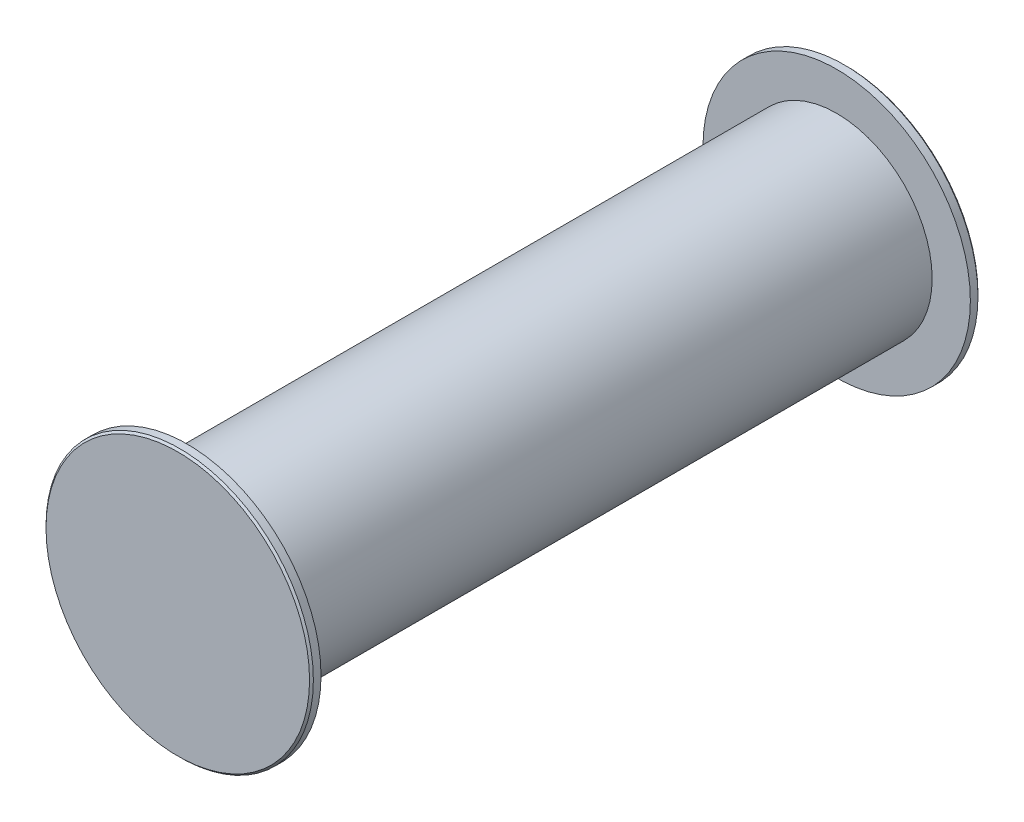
from build123d import *

# Parameters (mm, degrees)
ESQUISSE1_R          = 5
BASE_EXTRUSION_DEPTH = 34
ESQUISSE2_R          = 7
BOSS_EXTRU_1_DEPTH   = 0.5
CHANFREIN1_SIZE      = 0.1
BOSS_EXTRU_2_START   = 0.5
ESQUISSE3_R          = 7
BOSS_EXTRU_2_DEPTH   = 0.5
CHANFREIN2_SIZE      = 0.1


with BuildPart() as part:
    # Esquisse1 → Base-Extrusion (new body)
    with BuildSketch(Plane.XY):
        with Locations(Location((0, 0, 0), (0, 0, 180))):
            Circle(ESQUISSE1_R)
    extrude(amount=BASE_EXTRUSION_DEPTH)

    # Esquisse2 → Boss.-Extru.1 (add)
    with BuildSketch(Plane.XY.offset(34)):
        Circle(ESQUISSE2_R)
    extrude(amount=BOSS_EXTRU_1_DEPTH)

    # Chanfrein1
    chanfrein1_edges = [part.edges().sort_by_distance(p)[0] for p in [
        (-7, 0, 34.5),
    ]]
    chamfer(chanfrein1_edges, length=CHANFREIN1_SIZE)

    # Esquisse3 → Boss.-Extru.2 (add)
    with BuildSketch(Plane(origin=(0, 0, 0), x_dir=(-1, 0, 0), z_dir=(0, 0, -1)).offset(BOSS_EXTRU_2_START)):
        with Locations(Location((0, 0, 0), (0, 0, 180))):
            Circle(ESQUISSE3_R)
    extrude(amount=-BOSS_EXTRU_2_DEPTH)

    # Chanfrein2
    chanfrein2_edges = [part.edges().sort_by_distance(p)[0] for p in [
        (-7, 0, -0.5),
    ]]
    chamfer(chanfrein2_edges, length=CHANFREIN2_SIZE)


solid = part.part
